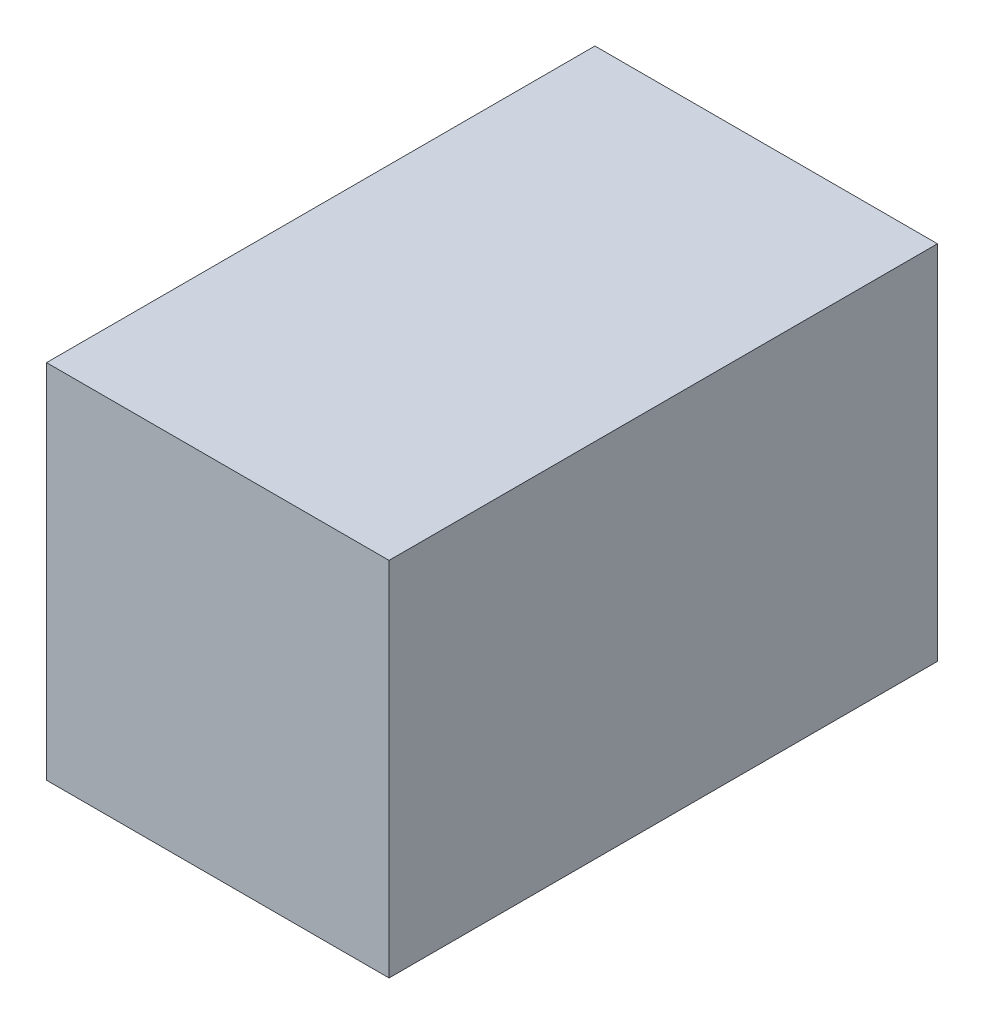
ISO-10303-21;
HEADER;
FILE_DESCRIPTION(('STEP AP214'),'2;1');
FILE_NAME('part.step','',(''),(''),'','','');
FILE_SCHEMA(('AUTOMOTIVE_DESIGN { 1 0 10303 214 1 1 1 1 }'));
ENDSEC;
DATA;
#1=APPLICATION_CONTEXT('core data for automotive mechanical design processes');
#2=APPLICATION_PROTOCOL_DEFINITION('international standard','automotive_design',2000,#1);
#3=PRODUCT_CONTEXT('',#1,'mechanical');
#4=PRODUCT('Part','Part','',(#3));
#5=PRODUCT_RELATED_PRODUCT_CATEGORY('part','',(#4));
#6=PRODUCT_DEFINITION_FORMATION('','',#4);
#7=PRODUCT_DEFINITION_CONTEXT('part definition',#1,'design');
#8=PRODUCT_DEFINITION('design','',#6,#7);
#9=PRODUCT_DEFINITION_SHAPE('','',#8);
#10=(LENGTH_UNIT() NAMED_UNIT(*) SI_UNIT(.MILLI.,.METRE.));
#11=(NAMED_UNIT(*) PLANE_ANGLE_UNIT() SI_UNIT($,.RADIAN.));
#12=(NAMED_UNIT(*) SI_UNIT($,.STERADIAN.) SOLID_ANGLE_UNIT());
#13=UNCERTAINTY_MEASURE_WITH_UNIT(LENGTH_MEASURE(1.E-05),#10,'distance_accuracy_value','');
#14=(GEOMETRIC_REPRESENTATION_CONTEXT(3) GLOBAL_UNCERTAINTY_ASSIGNED_CONTEXT((#13)) GLOBAL_UNIT_ASSIGNED_CONTEXT((#10,
#11,#12)) REPRESENTATION_CONTEXT('',''));
#15=CARTESIAN_POINT('',(0.,0.,0.));
#16=DIRECTION('',(0.,0.,1.));
#17=DIRECTION('',(1.,0.,0.));
#18=AXIS2_PLACEMENT_3D('',#15,#16,#17);
#19=CARTESIAN_POINT('',(-34.5047752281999,38.1,381.));
#20=DIRECTION('',(1.,0.,0.));
#21=DIRECTION('',(0.,0.,-1.));
#22=AXIS2_PLACEMENT_3D('',#19,#20,#21);
#23=PLANE('',#22);
#24=DIRECTION('',(0.,0.,1.));
#25=VECTOR('',#24,1.);
#26=CARTESIAN_POINT('',(-34.5047752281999,-38.1,381.));
#27=LINE('',#26,#25);
#28=CARTESIAN_POINT('',(-34.5047752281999,-38.1,381.));
#29=VERTEX_POINT('',#28);
#30=CARTESIAN_POINT('',(-34.5047752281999,-38.1,496.542489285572));
#31=VERTEX_POINT('',#30);
#32=EDGE_CURVE('E74',#29,#31,#27,.T.);
#33=ORIENTED_EDGE('',*,*,#32,.T.);
#34=DIRECTION('',(0.,-1.,0.));
#35=VECTOR('',#34,1.);
#36=CARTESIAN_POINT('',(-34.5047752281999,38.1,496.542489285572));
#37=LINE('',#36,#35);
#38=CARTESIAN_POINT('',(-34.5047752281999,38.1,496.542489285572));
#39=VERTEX_POINT('',#38);
#40=EDGE_CURVE('E11',#39,#31,#37,.T.);
#41=ORIENTED_EDGE('',*,*,#40,.F.);
#42=DIRECTION('',(0.,0.,1.));
#43=VECTOR('',#42,1.);
#44=CARTESIAN_POINT('',(-34.5047752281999,38.1,381.));
#45=LINE('',#44,#43);
#46=CARTESIAN_POINT('',(-34.5047752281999,38.1,381.));
#47=VERTEX_POINT('',#46);
#48=EDGE_CURVE('E92',#47,#39,#45,.T.);
#49=ORIENTED_EDGE('',*,*,#48,.F.);
#50=DIRECTION('',(0.,-1.,0.));
#51=VECTOR('',#50,1.);
#52=CARTESIAN_POINT('',(-34.5047752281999,38.1,381.));
#53=LINE('',#52,#51);
#54=EDGE_CURVE('E86',#47,#29,#53,.T.);
#55=ORIENTED_EDGE('',*,*,#54,.T.);
#56=EDGE_LOOP('',(#33,#41,#49,#55));
#57=FACE_BOUND('',#56,.T.);
#58=ADVANCED_FACE('F30',(#57),#23,.F.);
#59=CARTESIAN_POINT('',(-34.5047752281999,38.1,496.542489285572));
#60=DIRECTION('',(0.,0.,-1.));
#61=DIRECTION('',(-1.,0.,0.));
#62=AXIS2_PLACEMENT_3D('',#59,#60,#61);
#63=PLANE('',#62);
#64=DIRECTION('',(1.,0.,0.));
#65=VECTOR('',#64,1.);
#66=CARTESIAN_POINT('',(-34.5047752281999,-38.1,496.542489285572));
#67=LINE('',#66,#65);
#68=CARTESIAN_POINT('',(37.6616758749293,-38.1,496.542489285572));
#69=VERTEX_POINT('',#68);
#70=EDGE_CURVE('E70',#31,#69,#67,.T.);
#71=ORIENTED_EDGE('',*,*,#70,.T.);
#72=DIRECTION('',(0.,-1.,0.));
#73=VECTOR('',#72,1.);
#74=CARTESIAN_POINT('',(37.6616758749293,38.1,496.542489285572));
#75=LINE('',#74,#73);
#76=CARTESIAN_POINT('',(37.6616758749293,38.1,496.542489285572));
#77=VERTEX_POINT('',#76);
#78=EDGE_CURVE('E37',#77,#69,#75,.T.);
#79=ORIENTED_EDGE('',*,*,#78,.F.);
#80=DIRECTION('',(1.,0.,0.));
#81=VECTOR('',#80,1.);
#82=CARTESIAN_POINT('',(-34.5047752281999,38.1,496.542489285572));
#83=LINE('',#82,#81);
#84=EDGE_CURVE('E82',#39,#77,#83,.T.);
#85=ORIENTED_EDGE('',*,*,#84,.F.);
#86=ORIENTED_EDGE('',*,*,#40,.T.);
#87=EDGE_LOOP('',(#71,#79,#85,#86));
#88=FACE_BOUND('',#87,.T.);
#89=ADVANCED_FACE('F81',(#88),#63,.F.);
#90=CARTESIAN_POINT('',(37.6616758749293,38.1,381.));
#91=DIRECTION('',(-1.,0.,0.));
#92=DIRECTION('',(0.,0.,1.));
#93=AXIS2_PLACEMENT_3D('',#90,#91,#92);
#94=PLANE('',#93);
#95=DIRECTION('',(0.,0.,-1.));
#96=VECTOR('',#95,1.);
#97=CARTESIAN_POINT('',(37.6616758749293,-38.1,381.));
#98=LINE('',#97,#96);
#99=CARTESIAN_POINT('',(37.6616758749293,-38.1,381.));
#100=VERTEX_POINT('',#99);
#101=EDGE_CURVE('E75',#69,#100,#98,.T.);
#102=ORIENTED_EDGE('',*,*,#101,.T.);
#103=DIRECTION('',(0.,-1.,0.));
#104=VECTOR('',#103,1.);
#105=CARTESIAN_POINT('',(37.6616758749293,38.1,381.));
#106=LINE('',#105,#104);
#107=CARTESIAN_POINT('',(37.6616758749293,38.1,381.));
#108=VERTEX_POINT('',#107);
#109=EDGE_CURVE('E98',#108,#100,#106,.T.);
#110=ORIENTED_EDGE('',*,*,#109,.F.);
#111=DIRECTION('',(0.,0.,-1.));
#112=VECTOR('',#111,1.);
#113=CARTESIAN_POINT('',(37.6616758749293,38.1,381.));
#114=LINE('',#113,#112);
#115=EDGE_CURVE('E49',#77,#108,#114,.T.);
#116=ORIENTED_EDGE('',*,*,#115,.F.);
#117=ORIENTED_EDGE('',*,*,#78,.T.);
#118=EDGE_LOOP('',(#102,#110,#116,#117));
#119=FACE_BOUND('',#118,.T.);
#120=ADVANCED_FACE('F101',(#119),#94,.F.);
#121=CARTESIAN_POINT('',(-34.5047752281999,38.1,381.));
#122=DIRECTION('',(0.,0.,1.));
#123=DIRECTION('',(1.,0.,0.));
#124=AXIS2_PLACEMENT_3D('',#121,#122,#123);
#125=PLANE('',#124);
#126=DIRECTION('',(-1.,0.,0.));
#127=VECTOR('',#126,1.);
#128=CARTESIAN_POINT('',(-34.5047752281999,-38.1,381.));
#129=LINE('',#128,#127);
#130=EDGE_CURVE('E90',#100,#29,#129,.T.);
#131=ORIENTED_EDGE('',*,*,#130,.T.);
#132=ORIENTED_EDGE('',*,*,#54,.F.);
#133=DIRECTION('',(-1.,0.,0.));
#134=VECTOR('',#133,1.);
#135=CARTESIAN_POINT('',(-34.5047752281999,38.1,381.));
#136=LINE('',#135,#134);
#137=EDGE_CURVE('E44',#108,#47,#136,.T.);
#138=ORIENTED_EDGE('',*,*,#137,.F.);
#139=ORIENTED_EDGE('',*,*,#109,.T.);
#140=EDGE_LOOP('',(#131,#132,#138,#139));
#141=FACE_BOUND('',#140,.T.);
#142=ADVANCED_FACE('F103',(#141),#125,.F.);
#143=CARTESIAN_POINT('',(-34.5047752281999,38.1,496.542489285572));
#144=DIRECTION('',(0.,1.,0.));
#145=DIRECTION('',(0.,0.,1.));
#146=AXIS2_PLACEMENT_3D('',#143,#144,#145);
#147=PLANE('',#146);
#148=ORIENTED_EDGE('',*,*,#48,.T.);
#149=ORIENTED_EDGE('',*,*,#84,.T.);
#150=ORIENTED_EDGE('',*,*,#115,.T.);
#151=ORIENTED_EDGE('',*,*,#137,.T.);
#152=EDGE_LOOP('',(#148,#149,#150,#151));
#153=FACE_BOUND('',#152,.T.);
#154=ADVANCED_FACE('F104',(#153),#147,.T.);
#155=CARTESIAN_POINT('',(-34.5047752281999,-38.1,496.542489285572));
#156=DIRECTION('',(0.,1.,0.));
#157=DIRECTION('',(0.,0.,1.));
#158=AXIS2_PLACEMENT_3D('',#155,#156,#157);
#159=PLANE('',#158);
#160=ORIENTED_EDGE('',*,*,#32,.F.);
#161=ORIENTED_EDGE('',*,*,#130,.F.);
#162=ORIENTED_EDGE('',*,*,#101,.F.);
#163=ORIENTED_EDGE('',*,*,#70,.F.);
#164=EDGE_LOOP('',(#160,#161,#162,#163));
#165=FACE_BOUND('',#164,.T.);
#166=ADVANCED_FACE('F71',(#165),#159,.F.);
#167=CLOSED_SHELL('',(#58,#89,#120,#142,#154,#166));
#168=MANIFOLD_SOLID_BREP('B2',#167);
#169=ADVANCED_BREP_SHAPE_REPRESENTATION('',(#18,#168),#14);
#170=SHAPE_DEFINITION_REPRESENTATION(#9,#169);
ENDSEC;
END-ISO-10303-21;
